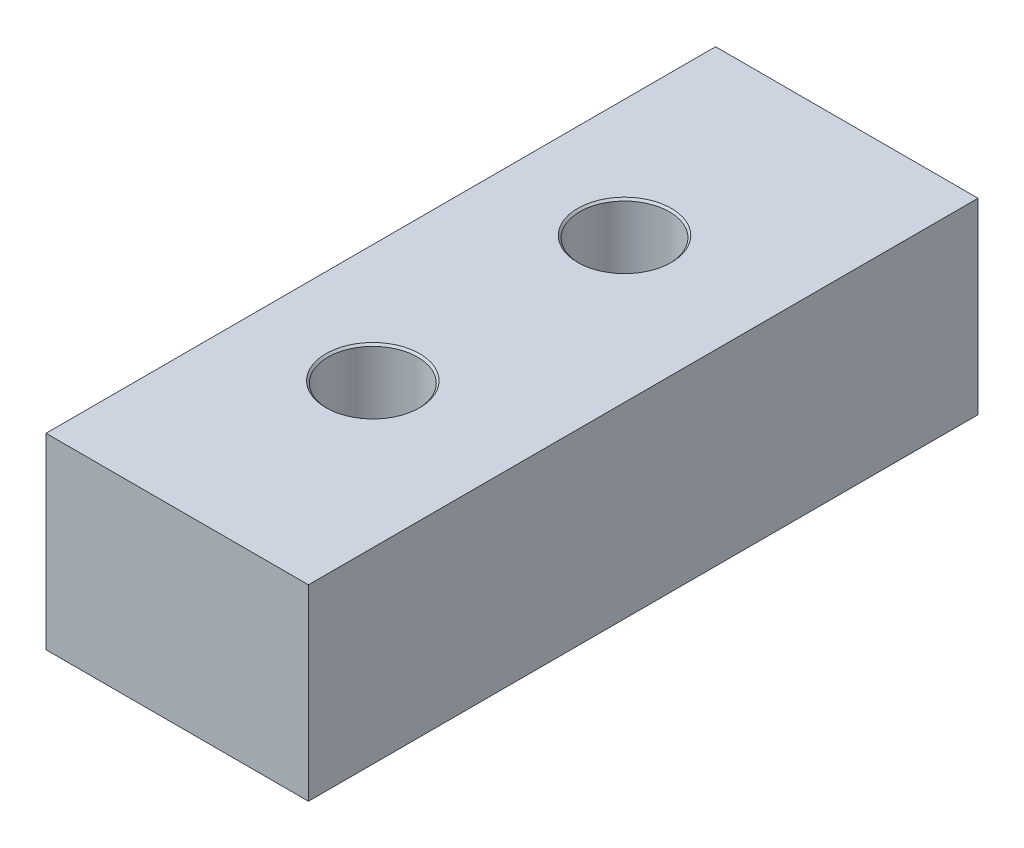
from build123d import *

# Parameters (mm, degrees)
SKETCH2_W                             = 49
SKETCH2_H                             = 125
HUGE_BLOCK_DEPTH                      = 17.5
F_8_0_3157_MM_DOWEL_HOLE1_D           = 8.01878
F_8_0_3157_MM_DOWEL_HOLE1_DEPTH       = 6.858
F_8_0_3157_MM_DOWEL_HOLE1_CSINK_D     = 9
F_8_0_3157_MM_DOWEL_HOLE1_CSINK_ANGLE = 90
CBORE_FOR_M12_SHCS4_AT_2_COUNT        = 2
CBORE_FOR_M12_SHCS4_AT_2_PITCH        = 46.99


with BuildPart() as part:
    # Sketch2 → HUGE BLOCK (new, symmetric)
    with BuildSketch(Plane(origin=(0, 0, 0), x_dir=(1, 0, 0), z_dir=(0, 1, 0))):
        Rectangle(SKETCH2_W, SKETCH2_H)
    extrude(amount=HUGE_BLOCK_DEPTH, both=True)

    # 8.0_.3157_mm Dowel Hole1
    with Locations(Plane(origin=(0, -17.5, 0), x_dir=(-1, 0, 0), z_dir=(0, -1, 0))):
        with Locations((14.187499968, 23.5), (-9.212499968, -23.5)):
            CounterSinkHole(F_8_0_3157_MM_DOWEL_HOLE1_D / 2, F_8_0_3157_MM_DOWEL_HOLE1_CSINK_D / 2, depth=F_8_0_3157_MM_DOWEL_HOLE1_DEPTH, counter_sink_angle=F_8_0_3157_MM_DOWEL_HOLE1_CSINK_ANGLE)

    # Sketch16 → CBORE for M12 SHCS4 (revolve, cut)
    with BuildSketch(Plane(origin=(-2.4875, 17.5, -23.495), x_dir=(0, 0, 1), z_dir=(1, 0, 0))):
        Polygon((0, 0), (0, 35), (5.75, 35), (5.3594, 34.6094), (5.3594, 26.5526), (5.75, 26.162), (8.382, 26.162), (8.382, 0.368), (8.75, 0), align=None)
    cbore_for_m12_shcs4 = revolve(axis=Axis((-2.4875, 23.85, -23.495), (0, -1, 0)), mode=Mode.SUBTRACT)

    # CBORE for M12 SHCS4 at 2: CBORE for M12 SHCS4 ×2
    with Locations(*[(0, 0, i * CBORE_FOR_M12_SHCS4_AT_2_PITCH) for i in range(1, CBORE_FOR_M12_SHCS4_AT_2_COUNT)]):
        add(cbore_for_m12_shcs4, mode=Mode.SUBTRACT)


solid = part.part
